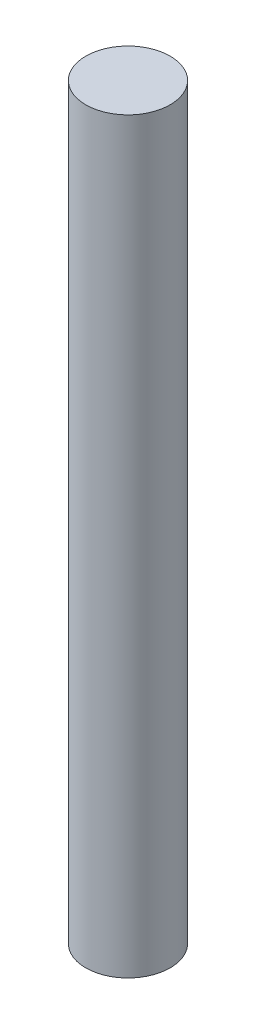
from build123d import *

# Parameters (mm, degrees)
SKETCH_1_R      = 0.80645
EXTRUDE_1_DEPTH = 7.14375


with BuildPart() as part:
    # Sketch 1 → Extrude 1 (new, symmetric)
    with BuildSketch(Plane(origin=(0, 0, 0), x_dir=(1, 0, 0), z_dir=(0, 1, 0))):
        with Locations(Location((0, 0, 0), (0, 0, 270))):
            Circle(SKETCH_1_R)
    extrude(amount=EXTRUDE_1_DEPTH, both=True)


solid = part.part
